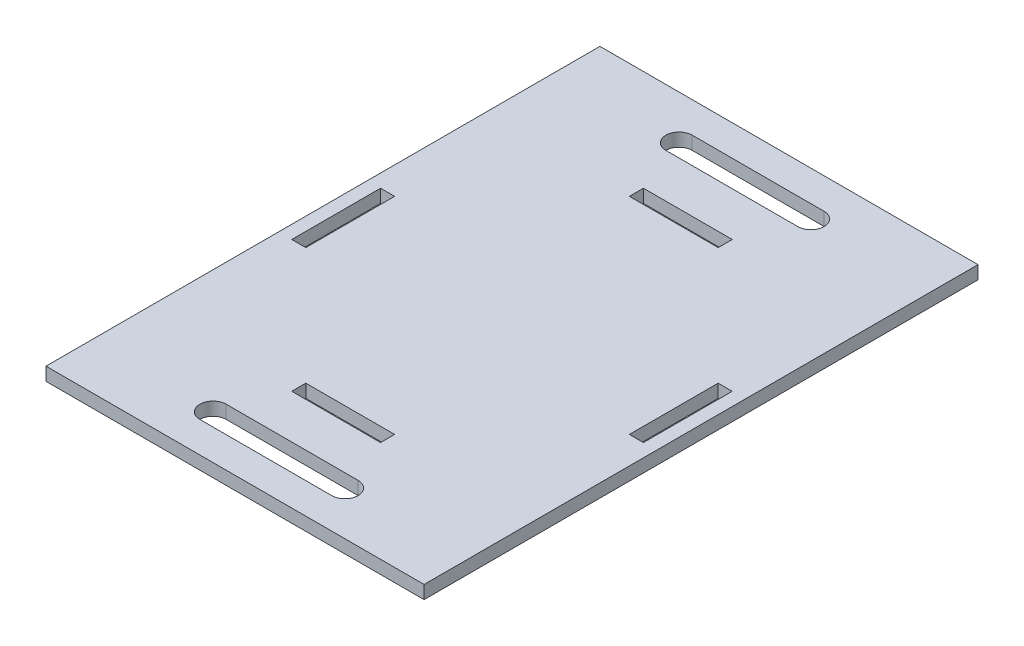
ISO-10303-21;
HEADER;
FILE_DESCRIPTION(('STEP AP214'),'2;1');
FILE_NAME('part.step','',(''),(''),'','','');
FILE_SCHEMA(('AUTOMOTIVE_DESIGN { 1 0 10303 214 1 1 1 1 }'));
ENDSEC;
DATA;
#1=APPLICATION_CONTEXT('core data for automotive mechanical design processes');
#2=APPLICATION_PROTOCOL_DEFINITION('international standard','automotive_design',2000,#1);
#3=PRODUCT_CONTEXT('',#1,'mechanical');
#4=PRODUCT('Part','Part','',(#3));
#5=PRODUCT_RELATED_PRODUCT_CATEGORY('part','',(#4));
#6=PRODUCT_DEFINITION_FORMATION('','',#4);
#7=PRODUCT_DEFINITION_CONTEXT('part definition',#1,'design');
#8=PRODUCT_DEFINITION('design','',#6,#7);
#9=PRODUCT_DEFINITION_SHAPE('','',#8);
#10=(LENGTH_UNIT() NAMED_UNIT(*) SI_UNIT(.MILLI.,.METRE.));
#11=(NAMED_UNIT(*) PLANE_ANGLE_UNIT() SI_UNIT($,.RADIAN.));
#12=(NAMED_UNIT(*) SI_UNIT($,.STERADIAN.) SOLID_ANGLE_UNIT());
#13=UNCERTAINTY_MEASURE_WITH_UNIT(LENGTH_MEASURE(1.E-05),#10,'distance_accuracy_value','');
#14=(GEOMETRIC_REPRESENTATION_CONTEXT(3) GLOBAL_UNCERTAINTY_ASSIGNED_CONTEXT((#13)) GLOBAL_UNIT_ASSIGNED_CONTEXT((#10,
#11,#12)) REPRESENTATION_CONTEXT('',''));
#15=CARTESIAN_POINT('',(0.,0.,0.));
#16=DIRECTION('',(0.,0.,1.));
#17=DIRECTION('',(1.,0.,0.));
#18=AXIS2_PLACEMENT_3D('',#15,#16,#17);
#19=CARTESIAN_POINT('',(0.,15.,0.));
#20=DIRECTION('',(0.,-1.,0.));
#21=DIRECTION('',(0.,0.,-1.));
#22=AXIS2_PLACEMENT_3D('',#19,#20,#21);
#23=PLANE('',#22);
#24=DIRECTION('',(0.,0.,1.));
#25=VECTOR('',#24,1.);
#26=CARTESIAN_POINT('',(-50.5,15.,-200.));
#27=LINE('',#26,#25);
#28=CARTESIAN_POINT('',(-50.5,15.,-200.));
#29=VERTEX_POINT('',#28);
#30=CARTESIAN_POINT('',(-50.5,15.,-184.));
#31=VERTEX_POINT('',#30);
#32=EDGE_CURVE('E345',#29,#31,#27,.T.);
#33=ORIENTED_EDGE('',*,*,#32,.F.);
#34=DIRECTION('',(-1.,0.,0.));
#35=VECTOR('',#34,1.);
#36=CARTESIAN_POINT('',(-50.5,15.,-200.));
#37=LINE('',#36,#35);
#38=CARTESIAN_POINT('',(50.5,15.,-200.));
#39=VERTEX_POINT('',#38);
#40=EDGE_CURVE('E353',#39,#29,#37,.T.);
#41=ORIENTED_EDGE('',*,*,#40,.F.);
#42=DIRECTION('',(0.,0.,-1.));
#43=VECTOR('',#42,1.);
#44=CARTESIAN_POINT('',(50.5,15.,-200.));
#45=LINE('',#44,#43);
#46=CARTESIAN_POINT('',(50.5,15.,-184.));
#47=VERTEX_POINT('',#46);
#48=EDGE_CURVE('E350',#47,#39,#45,.T.);
#49=ORIENTED_EDGE('',*,*,#48,.F.);
#50=DIRECTION('',(1.,0.,0.));
#51=VECTOR('',#50,1.);
#52=CARTESIAN_POINT('',(-50.5,15.,-184.));
#53=LINE('',#52,#51);
#54=EDGE_CURVE('E347',#31,#47,#53,.T.);
#55=ORIENTED_EDGE('',*,*,#54,.F.);
#56=EDGE_LOOP('',(#33,#41,#49,#55));
#57=FACE_BOUND('',#56,.T.);
#58=DIRECTION('',(0.,0.,-1.));
#59=VECTOR('',#58,1.);
#60=CARTESIAN_POINT('',(200.,15.,-50.5));
#61=LINE('',#60,#59);
#62=CARTESIAN_POINT('',(200.,15.,50.5));
#63=VERTEX_POINT('',#62);
#64=CARTESIAN_POINT('',(200.,15.,-50.5));
#65=VERTEX_POINT('',#64);
#66=EDGE_CURVE('E407',#63,#65,#61,.T.);
#67=ORIENTED_EDGE('',*,*,#66,.F.);
#68=DIRECTION('',(1.,0.,0.));
#69=VECTOR('',#68,1.);
#70=CARTESIAN_POINT('',(200.,15.,50.5));
#71=LINE('',#70,#69);
#72=CARTESIAN_POINT('',(184.,15.,50.5));
#73=VERTEX_POINT('',#72);
#74=EDGE_CURVE('E415',#73,#63,#71,.T.);
#75=ORIENTED_EDGE('',*,*,#74,.F.);
#76=DIRECTION('',(0.,0.,1.));
#77=VECTOR('',#76,1.);
#78=CARTESIAN_POINT('',(184.,15.,-50.5));
#79=LINE('',#78,#77);
#80=CARTESIAN_POINT('',(184.,15.,-50.5));
#81=VERTEX_POINT('',#80);
#82=EDGE_CURVE('E412',#81,#73,#79,.T.);
#83=ORIENTED_EDGE('',*,*,#82,.F.);
#84=DIRECTION('',(-1.,0.,0.));
#85=VECTOR('',#84,1.);
#86=CARTESIAN_POINT('',(200.,15.,-50.5));
#87=LINE('',#86,#85);
#88=EDGE_CURVE('E409',#65,#81,#87,.T.);
#89=ORIENTED_EDGE('',*,*,#88,.F.);
#90=EDGE_LOOP('',(#67,#75,#83,#89));
#91=FACE_BOUND('',#90,.T.);
#92=DIRECTION('',(0.,0.,1.));
#93=VECTOR('',#92,1.);
#94=CARTESIAN_POINT('',(-215.,15.,215.));
#95=LINE('',#94,#93);
#96=CARTESIAN_POINT('',(-215.,15.,-315.));
#97=VERTEX_POINT('',#96);
#98=CARTESIAN_POINT('',(-215.,15.,315.));
#99=VERTEX_POINT('',#98);
#100=EDGE_CURVE('E11',#97,#99,#95,.T.);
#101=ORIENTED_EDGE('',*,*,#100,.T.);
#102=DIRECTION('',(1.,0.,0.));
#103=VECTOR('',#102,1.);
#104=CARTESIAN_POINT('',(-215.,15.,315.));
#105=LINE('',#104,#103);
#106=CARTESIAN_POINT('',(215.,15.,315.));
#107=VERTEX_POINT('',#106);
#108=EDGE_CURVE('E260',#99,#107,#105,.T.);
#109=ORIENTED_EDGE('',*,*,#108,.T.);
#110=DIRECTION('',(0.,0.,-1.));
#111=VECTOR('',#110,1.);
#112=CARTESIAN_POINT('',(215.,15.,215.));
#113=LINE('',#112,#111);
#114=CARTESIAN_POINT('',(215.,15.,-315.));
#115=VERTEX_POINT('',#114);
#116=EDGE_CURVE('E42',#107,#115,#113,.T.);
#117=ORIENTED_EDGE('',*,*,#116,.T.);
#118=DIRECTION('',(-1.,0.,0.));
#119=VECTOR('',#118,1.);
#120=CARTESIAN_POINT('',(-215.,15.,-315.));
#121=LINE('',#120,#119);
#122=EDGE_CURVE('E301',#115,#97,#121,.T.);
#123=ORIENTED_EDGE('',*,*,#122,.T.);
#124=EDGE_LOOP('',(#101,#109,#117,#123));
#125=FACE_BOUND('',#124,.T.);
#126=DIRECTION('',(-1.,0.,0.));
#127=VECTOR('',#126,1.);
#128=CARTESIAN_POINT('',(-200.,15.,-50.4999999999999));
#129=LINE('',#128,#127);
#130=CARTESIAN_POINT('',(-184.,15.,-50.5));
#131=VERTEX_POINT('',#130);
#132=CARTESIAN_POINT('',(-200.,15.,-50.4999999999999));
#133=VERTEX_POINT('',#132);
#134=EDGE_CURVE('E376',#131,#133,#129,.T.);
#135=ORIENTED_EDGE('',*,*,#134,.F.);
#136=DIRECTION('',(0.,0.,-1.));
#137=VECTOR('',#136,1.);
#138=CARTESIAN_POINT('',(-184.,15.,-50.5));
#139=LINE('',#138,#137);
#140=CARTESIAN_POINT('',(-184.,15.,50.5));
#141=VERTEX_POINT('',#140);
#142=EDGE_CURVE('E384',#141,#131,#139,.T.);
#143=ORIENTED_EDGE('',*,*,#142,.F.);
#144=DIRECTION('',(1.,0.,0.));
#145=VECTOR('',#144,1.);
#146=CARTESIAN_POINT('',(-200.,15.,50.4999999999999));
#147=LINE('',#146,#145);
#148=CARTESIAN_POINT('',(-200.,15.,50.4999999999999));
#149=VERTEX_POINT('',#148);
#150=EDGE_CURVE('E381',#149,#141,#147,.T.);
#151=ORIENTED_EDGE('',*,*,#150,.F.);
#152=DIRECTION('',(0.,0.,1.));
#153=VECTOR('',#152,1.);
#154=CARTESIAN_POINT('',(-200.,15.,-50.4999999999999));
#155=LINE('',#154,#153);
#156=EDGE_CURVE('E378',#133,#149,#155,.T.);
#157=ORIENTED_EDGE('',*,*,#156,.F.);
#158=EDGE_LOOP('',(#135,#143,#151,#157));
#159=FACE_BOUND('',#158,.T.);
#160=DIRECTION('',(1.,0.,0.));
#161=VECTOR('',#160,1.);
#162=CARTESIAN_POINT('',(-50.5,15.,200.));
#163=LINE('',#162,#161);
#164=CARTESIAN_POINT('',(-50.5,15.,200.));
#165=VERTEX_POINT('',#164);
#166=CARTESIAN_POINT('',(50.5,15.,200.));
#167=VERTEX_POINT('',#166);
#168=EDGE_CURVE('E319',#165,#167,#163,.T.);
#169=ORIENTED_EDGE('',*,*,#168,.F.);
#170=DIRECTION('',(0.,0.,1.));
#171=VECTOR('',#170,1.);
#172=CARTESIAN_POINT('',(-50.5,15.,200.));
#173=LINE('',#172,#171);
#174=CARTESIAN_POINT('',(-50.5,15.,184.));
#175=VERTEX_POINT('',#174);
#176=EDGE_CURVE('E326',#175,#165,#173,.T.);
#177=ORIENTED_EDGE('',*,*,#176,.F.);
#178=DIRECTION('',(-1.,0.,0.));
#179=VECTOR('',#178,1.);
#180=CARTESIAN_POINT('',(-50.5,15.,184.));
#181=LINE('',#180,#179);
#182=CARTESIAN_POINT('',(50.5,15.,184.));
#183=VERTEX_POINT('',#182);
#184=EDGE_CURVE('E324',#183,#175,#181,.T.);
#185=ORIENTED_EDGE('',*,*,#184,.F.);
#186=DIRECTION('',(0.,0.,-1.));
#187=VECTOR('',#186,1.);
#188=CARTESIAN_POINT('',(50.5,15.,200.));
#189=LINE('',#188,#187);
#190=EDGE_CURVE('E321',#167,#183,#189,.T.);
#191=ORIENTED_EDGE('',*,*,#190,.F.);
#192=EDGE_LOOP('',(#169,#177,#185,#191));
#193=FACE_BOUND('',#192,.T.);
#194=DIRECTION('',(-1.,0.,0.));
#195=VECTOR('',#194,1.);
#196=CARTESIAN_POINT('',(75.,15.,-280.));
#197=LINE('',#196,#195);
#198=CARTESIAN_POINT('',(75.,15.,-280.));
#199=VERTEX_POINT('',#198);
#200=CARTESIAN_POINT('',(-75.,15.,-280.));
#201=VERTEX_POINT('',#200);
#202=EDGE_CURVE('E291',#199,#201,#197,.T.);
#203=ORIENTED_EDGE('',*,*,#202,.F.);
#204=CARTESIAN_POINT('',(75.,15.,-265.));
#205=DIRECTION('',(0.,1.,0.));
#206=DIRECTION('',(0.,0.,1.));
#207=AXIS2_PLACEMENT_3D('',#204,#205,#206);
#208=CIRCLE('',#207,15.);
#209=CARTESIAN_POINT('',(75.,15.,-250.));
#210=VERTEX_POINT('',#209);
#211=EDGE_CURVE('E273',#210,#199,#208,.T.);
#212=ORIENTED_EDGE('',*,*,#211,.F.);
#213=DIRECTION('',(1.,0.,0.));
#214=VECTOR('',#213,1.);
#215=CARTESIAN_POINT('',(75.,15.,-250.));
#216=LINE('',#215,#214);
#217=CARTESIAN_POINT('',(-75.,15.,-250.));
#218=VERTEX_POINT('',#217);
#219=EDGE_CURVE('E280',#218,#210,#216,.T.);
#220=ORIENTED_EDGE('',*,*,#219,.F.);
#221=CARTESIAN_POINT('',(-75.,15.,-265.));
#222=DIRECTION('',(0.,1.,0.));
#223=DIRECTION('',(0.,0.,1.));
#224=AXIS2_PLACEMENT_3D('',#221,#222,#223);
#225=CIRCLE('',#224,15.);
#226=EDGE_CURVE('E294',#201,#218,#225,.T.);
#227=ORIENTED_EDGE('',*,*,#226,.F.);
#228=EDGE_LOOP('',(#203,#212,#220,#227));
#229=FACE_BOUND('',#228,.T.);
#230=DIRECTION('',(-1.,0.,0.));
#231=VECTOR('',#230,1.);
#232=CARTESIAN_POINT('',(75.,15.,250.));
#233=LINE('',#232,#231);
#234=CARTESIAN_POINT('',(75.,15.,250.));
#235=VERTEX_POINT('',#234);
#236=CARTESIAN_POINT('',(-75.,15.,250.));
#237=VERTEX_POINT('',#236);
#238=EDGE_CURVE('E254',#235,#237,#233,.T.);
#239=ORIENTED_EDGE('',*,*,#238,.F.);
#240=CARTESIAN_POINT('',(75.,15.,265.));
#241=DIRECTION('',(0.,1.,0.));
#242=DIRECTION('',(0.,0.,-1.));
#243=AXIS2_PLACEMENT_3D('',#240,#241,#242);
#244=CIRCLE('',#243,15.);
#245=CARTESIAN_POINT('',(75.,15.,280.));
#246=VERTEX_POINT('',#245);
#247=EDGE_CURVE('E228',#246,#235,#244,.T.);
#248=ORIENTED_EDGE('',*,*,#247,.F.);
#249=DIRECTION('',(1.,0.,0.));
#250=VECTOR('',#249,1.);
#251=CARTESIAN_POINT('',(75.,15.,280.));
#252=LINE('',#251,#250);
#253=CARTESIAN_POINT('',(-75.,15.,280.));
#254=VERTEX_POINT('',#253);
#255=EDGE_CURVE('E245',#254,#246,#252,.T.);
#256=ORIENTED_EDGE('',*,*,#255,.F.);
#257=CARTESIAN_POINT('',(-75.,15.,265.));
#258=DIRECTION('',(0.,1.,0.));
#259=DIRECTION('',(0.,0.,-1.));
#260=AXIS2_PLACEMENT_3D('',#257,#258,#259);
#261=CIRCLE('',#260,15.);
#262=EDGE_CURVE('E248',#237,#254,#261,.T.);
#263=ORIENTED_EDGE('',*,*,#262,.F.);
#264=EDGE_LOOP('',(#239,#248,#256,#263));
#265=FACE_BOUND('',#264,.T.);
#266=ADVANCED_FACE('F33',(#57,#91,#125,#159,#193,#229,#265),#23,.F.);
#267=CARTESIAN_POINT('',(0.,0.,0.));
#268=DIRECTION('',(0.,-1.,0.));
#269=DIRECTION('',(0.,0.,-1.));
#270=AXIS2_PLACEMENT_3D('',#267,#268,#269);
#271=PLANE('',#270);
#272=DIRECTION('',(0.,0.,-1.));
#273=VECTOR('',#272,1.);
#274=CARTESIAN_POINT('',(215.,0.,215.));
#275=LINE('',#274,#273);
#276=CARTESIAN_POINT('',(215.,0.,315.));
#277=VERTEX_POINT('',#276);
#278=CARTESIAN_POINT('',(215.,0.,-315.));
#279=VERTEX_POINT('',#278);
#280=EDGE_CURVE('E437',#277,#279,#275,.T.);
#281=ORIENTED_EDGE('',*,*,#280,.F.);
#282=DIRECTION('',(1.,0.,0.));
#283=VECTOR('',#282,1.);
#284=CARTESIAN_POINT('',(-215.,0.,315.));
#285=LINE('',#284,#283);
#286=CARTESIAN_POINT('',(-215.,0.,315.));
#287=VERTEX_POINT('',#286);
#288=EDGE_CURVE('E264',#287,#277,#285,.T.);
#289=ORIENTED_EDGE('',*,*,#288,.F.);
#290=DIRECTION('',(0.,0.,1.));
#291=VECTOR('',#290,1.);
#292=CARTESIAN_POINT('',(-215.,0.,215.));
#293=LINE('',#292,#291);
#294=CARTESIAN_POINT('',(-215.,0.,-315.));
#295=VERTEX_POINT('',#294);
#296=EDGE_CURVE('E37',#295,#287,#293,.T.);
#297=ORIENTED_EDGE('',*,*,#296,.F.);
#298=DIRECTION('',(-1.,0.,0.));
#299=VECTOR('',#298,1.);
#300=CARTESIAN_POINT('',(-215.,0.,-315.));
#301=LINE('',#300,#299);
#302=EDGE_CURVE('E308',#279,#295,#301,.T.);
#303=ORIENTED_EDGE('',*,*,#302,.F.);
#304=EDGE_LOOP('',(#281,#289,#297,#303));
#305=FACE_BOUND('',#304,.T.);
#306=DIRECTION('',(1.,0.,0.));
#307=VECTOR('',#306,1.);
#308=CARTESIAN_POINT('',(200.,0.,50.5));
#309=LINE('',#308,#307);
#310=CARTESIAN_POINT('',(184.,0.,50.5));
#311=VERTEX_POINT('',#310);
#312=CARTESIAN_POINT('',(200.,0.,50.5));
#313=VERTEX_POINT('',#312);
#314=EDGE_CURVE('E410',#311,#313,#309,.T.);
#315=ORIENTED_EDGE('',*,*,#314,.T.);
#316=DIRECTION('',(0.,0.,-1.));
#317=VECTOR('',#316,1.);
#318=CARTESIAN_POINT('',(200.,0.,-50.5));
#319=LINE('',#318,#317);
#320=CARTESIAN_POINT('',(200.,0.,-50.5));
#321=VERTEX_POINT('',#320);
#322=EDGE_CURVE('E406',#313,#321,#319,.T.);
#323=ORIENTED_EDGE('',*,*,#322,.T.);
#324=DIRECTION('',(-1.,0.,0.));
#325=VECTOR('',#324,1.);
#326=CARTESIAN_POINT('',(200.,0.,-50.5));
#327=LINE('',#326,#325);
#328=CARTESIAN_POINT('',(184.,0.,-50.5));
#329=VERTEX_POINT('',#328);
#330=EDGE_CURVE('E420',#321,#329,#327,.T.);
#331=ORIENTED_EDGE('',*,*,#330,.T.);
#332=DIRECTION('',(0.,0.,1.));
#333=VECTOR('',#332,1.);
#334=CARTESIAN_POINT('',(184.,0.,-50.5));
#335=LINE('',#334,#333);
#336=EDGE_CURVE('E423',#329,#311,#335,.T.);
#337=ORIENTED_EDGE('',*,*,#336,.T.);
#338=EDGE_LOOP('',(#315,#323,#331,#337));
#339=FACE_BOUND('',#338,.T.);
#340=DIRECTION('',(0.,0.,-1.));
#341=VECTOR('',#340,1.);
#342=CARTESIAN_POINT('',(-184.,0.,-50.5));
#343=LINE('',#342,#341);
#344=CARTESIAN_POINT('',(-184.,0.,50.5));
#345=VERTEX_POINT('',#344);
#346=CARTESIAN_POINT('',(-184.,0.,-50.5));
#347=VERTEX_POINT('',#346);
#348=EDGE_CURVE('E379',#345,#347,#343,.T.);
#349=ORIENTED_EDGE('',*,*,#348,.T.);
#350=DIRECTION('',(-1.,0.,0.));
#351=VECTOR('',#350,1.);
#352=CARTESIAN_POINT('',(-200.,0.,-50.4999999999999));
#353=LINE('',#352,#351);
#354=CARTESIAN_POINT('',(-200.,0.,-50.4999999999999));
#355=VERTEX_POINT('',#354);
#356=EDGE_CURVE('E375',#347,#355,#353,.T.);
#357=ORIENTED_EDGE('',*,*,#356,.T.);
#358=DIRECTION('',(0.,0.,1.));
#359=VECTOR('',#358,1.);
#360=CARTESIAN_POINT('',(-200.,0.,-50.4999999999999));
#361=LINE('',#360,#359);
#362=CARTESIAN_POINT('',(-200.,0.,50.4999999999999));
#363=VERTEX_POINT('',#362);
#364=EDGE_CURVE('E389',#355,#363,#361,.T.);
#365=ORIENTED_EDGE('',*,*,#364,.T.);
#366=DIRECTION('',(1.,0.,0.));
#367=VECTOR('',#366,1.);
#368=CARTESIAN_POINT('',(-200.,0.,50.4999999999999));
#369=LINE('',#368,#367);
#370=EDGE_CURVE('E392',#363,#345,#369,.T.);
#371=ORIENTED_EDGE('',*,*,#370,.T.);
#372=EDGE_LOOP('',(#349,#357,#365,#371));
#373=FACE_BOUND('',#372,.T.);
#374=DIRECTION('',(-1.,0.,0.));
#375=VECTOR('',#374,1.);
#376=CARTESIAN_POINT('',(-50.5,0.,-200.));
#377=LINE('',#376,#375);
#378=CARTESIAN_POINT('',(50.5,0.,-200.));
#379=VERTEX_POINT('',#378);
#380=CARTESIAN_POINT('',(-50.5,0.,-200.));
#381=VERTEX_POINT('',#380);
#382=EDGE_CURVE('E348',#379,#381,#377,.T.);
#383=ORIENTED_EDGE('',*,*,#382,.T.);
#384=DIRECTION('',(0.,0.,1.));
#385=VECTOR('',#384,1.);
#386=CARTESIAN_POINT('',(-50.5,0.,-200.));
#387=LINE('',#386,#385);
#388=CARTESIAN_POINT('',(-50.5,0.,-184.));
#389=VERTEX_POINT('',#388);
#390=EDGE_CURVE('E344',#381,#389,#387,.T.);
#391=ORIENTED_EDGE('',*,*,#390,.T.);
#392=DIRECTION('',(1.,0.,0.));
#393=VECTOR('',#392,1.);
#394=CARTESIAN_POINT('',(-50.5,0.,-184.));
#395=LINE('',#394,#393);
#396=CARTESIAN_POINT('',(50.5,0.,-184.));
#397=VERTEX_POINT('',#396);
#398=EDGE_CURVE('E358',#389,#397,#395,.T.);
#399=ORIENTED_EDGE('',*,*,#398,.T.);
#400=DIRECTION('',(0.,0.,-1.));
#401=VECTOR('',#400,1.);
#402=CARTESIAN_POINT('',(50.5,0.,-200.));
#403=LINE('',#402,#401);
#404=EDGE_CURVE('E361',#397,#379,#403,.T.);
#405=ORIENTED_EDGE('',*,*,#404,.T.);
#406=EDGE_LOOP('',(#383,#391,#399,#405));
#407=FACE_BOUND('',#406,.T.);
#408=DIRECTION('',(0.,0.,1.));
#409=VECTOR('',#408,1.);
#410=CARTESIAN_POINT('',(-50.5,0.,200.));
#411=LINE('',#410,#409);
#412=CARTESIAN_POINT('',(-50.5,0.,184.));
#413=VERTEX_POINT('',#412);
#414=CARTESIAN_POINT('',(-50.5,0.,200.));
#415=VERTEX_POINT('',#414);
#416=EDGE_CURVE('E322',#413,#415,#411,.T.);
#417=ORIENTED_EDGE('',*,*,#416,.T.);
#418=DIRECTION('',(1.,0.,0.));
#419=VECTOR('',#418,1.);
#420=CARTESIAN_POINT('',(-50.5,0.,200.));
#421=LINE('',#420,#419);
#422=CARTESIAN_POINT('',(50.5,0.,200.));
#423=VERTEX_POINT('',#422);
#424=EDGE_CURVE('E58',#415,#423,#421,.T.);
#425=ORIENTED_EDGE('',*,*,#424,.T.);
#426=DIRECTION('',(0.,0.,-1.));
#427=VECTOR('',#426,1.);
#428=CARTESIAN_POINT('',(50.5,0.,200.));
#429=LINE('',#428,#427);
#430=CARTESIAN_POINT('',(50.5,0.,184.));
#431=VERTEX_POINT('',#430);
#432=EDGE_CURVE('E330',#423,#431,#429,.T.);
#433=ORIENTED_EDGE('',*,*,#432,.T.);
#434=DIRECTION('',(-1.,0.,0.));
#435=VECTOR('',#434,1.);
#436=CARTESIAN_POINT('',(-50.5,0.,184.));
#437=LINE('',#436,#435);
#438=EDGE_CURVE('E333',#431,#413,#437,.T.);
#439=ORIENTED_EDGE('',*,*,#438,.T.);
#440=EDGE_LOOP('',(#417,#425,#433,#439));
#441=FACE_BOUND('',#440,.T.);
#442=CARTESIAN_POINT('',(75.,0.,-265.));
#443=DIRECTION('',(0.,1.,0.));
#444=DIRECTION('',(0.,0.,1.));
#445=AXIS2_PLACEMENT_3D('',#442,#443,#444);
#446=CIRCLE('',#445,15.);
#447=CARTESIAN_POINT('',(75.,0.,-250.));
#448=VERTEX_POINT('',#447);
#449=CARTESIAN_POINT('',(75.,0.,-280.));
#450=VERTEX_POINT('',#449);
#451=EDGE_CURVE('E276',#448,#450,#446,.T.);
#452=ORIENTED_EDGE('',*,*,#451,.T.);
#453=DIRECTION('',(-1.,0.,0.));
#454=VECTOR('',#453,1.);
#455=CARTESIAN_POINT('',(75.,0.,-280.));
#456=LINE('',#455,#454);
#457=CARTESIAN_POINT('',(-75.,0.,-280.));
#458=VERTEX_POINT('',#457);
#459=EDGE_CURVE('E279',#450,#458,#456,.T.);
#460=ORIENTED_EDGE('',*,*,#459,.T.);
#461=CARTESIAN_POINT('',(-75.,0.,-265.));
#462=DIRECTION('',(0.,1.,0.));
#463=DIRECTION('',(0.,0.,1.));
#464=AXIS2_PLACEMENT_3D('',#461,#462,#463);
#465=CIRCLE('',#464,15.);
#466=CARTESIAN_POINT('',(-75.,0.,-250.));
#467=VERTEX_POINT('',#466);
#468=EDGE_CURVE('E283',#458,#467,#465,.T.);
#469=ORIENTED_EDGE('',*,*,#468,.T.);
#470=DIRECTION('',(1.,0.,0.));
#471=VECTOR('',#470,1.);
#472=CARTESIAN_POINT('',(75.,0.,-250.));
#473=LINE('',#472,#471);
#474=EDGE_CURVE('E286',#467,#448,#473,.T.);
#475=ORIENTED_EDGE('',*,*,#474,.T.);
#476=EDGE_LOOP('',(#452,#460,#469,#475));
#477=FACE_BOUND('',#476,.T.);
#478=CARTESIAN_POINT('',(75.,0.,265.));
#479=DIRECTION('',(0.,1.,0.));
#480=DIRECTION('',(0.,0.,-1.));
#481=AXIS2_PLACEMENT_3D('',#478,#479,#480);
#482=CIRCLE('',#481,15.);
#483=CARTESIAN_POINT('',(75.,0.,280.));
#484=VERTEX_POINT('',#483);
#485=CARTESIAN_POINT('',(75.,0.,250.));
#486=VERTEX_POINT('',#485);
#487=EDGE_CURVE('E225',#484,#486,#482,.T.);
#488=ORIENTED_EDGE('',*,*,#487,.T.);
#489=DIRECTION('',(-1.,0.,0.));
#490=VECTOR('',#489,1.);
#491=CARTESIAN_POINT('',(75.,0.,250.));
#492=LINE('',#491,#490);
#493=CARTESIAN_POINT('',(-75.,0.,250.));
#494=VERTEX_POINT('',#493);
#495=EDGE_CURVE('E237',#486,#494,#492,.T.);
#496=ORIENTED_EDGE('',*,*,#495,.T.);
#497=CARTESIAN_POINT('',(-75.,0.,265.));
#498=DIRECTION('',(0.,1.,0.));
#499=DIRECTION('',(0.,0.,-1.));
#500=AXIS2_PLACEMENT_3D('',#497,#498,#499);
#501=CIRCLE('',#500,15.);
#502=CARTESIAN_POINT('',(-75.,0.,280.));
#503=VERTEX_POINT('',#502);
#504=EDGE_CURVE('E241',#494,#503,#501,.T.);
#505=ORIENTED_EDGE('',*,*,#504,.T.);
#506=DIRECTION('',(1.,0.,0.));
#507=VECTOR('',#506,1.);
#508=CARTESIAN_POINT('',(75.,0.,280.));
#509=LINE('',#508,#507);
#510=EDGE_CURVE('E233',#503,#484,#509,.T.);
#511=ORIENTED_EDGE('',*,*,#510,.T.);
#512=EDGE_LOOP('',(#488,#496,#505,#511));
#513=FACE_BOUND('',#512,.T.);
#514=ADVANCED_FACE('F243',(#305,#339,#373,#407,#441,#477,#513),#271,.T.);
#515=CARTESIAN_POINT('',(215.,15.,215.));
#516=DIRECTION('',(-1.,0.,0.));
#517=DIRECTION('',(0.,0.,1.));
#518=AXIS2_PLACEMENT_3D('',#515,#516,#517);
#519=PLANE('',#518);
#520=ORIENTED_EDGE('',*,*,#280,.T.);
#521=DIRECTION('',(0.,1.,0.));
#522=VECTOR('',#521,1.);
#523=CARTESIAN_POINT('',(215.,0.,-315.));
#524=LINE('',#523,#522);
#525=EDGE_CURVE('E311',#279,#115,#524,.T.);
#526=ORIENTED_EDGE('',*,*,#525,.T.);
#527=ORIENTED_EDGE('',*,*,#116,.F.);
#528=DIRECTION('',(0.,1.,0.));
#529=VECTOR('',#528,1.);
#530=CARTESIAN_POINT('',(215.,0.,315.));
#531=LINE('',#530,#529);
#532=EDGE_CURVE('E270',#277,#107,#531,.T.);
#533=ORIENTED_EDGE('',*,*,#532,.F.);
#534=EDGE_LOOP('',(#520,#526,#527,#533));
#535=FACE_BOUND('',#534,.T.);
#536=ADVANCED_FACE('F35',(#535),#519,.F.);
#537=CARTESIAN_POINT('',(-215.,15.,215.));
#538=DIRECTION('',(1.,0.,0.));
#539=DIRECTION('',(0.,0.,-1.));
#540=AXIS2_PLACEMENT_3D('',#537,#538,#539);
#541=PLANE('',#540);
#542=ORIENTED_EDGE('',*,*,#296,.T.);
#543=DIRECTION('',(0.,1.,0.));
#544=VECTOR('',#543,1.);
#545=CARTESIAN_POINT('',(-215.,0.,315.));
#546=LINE('',#545,#544);
#547=EDGE_CURVE('E267',#287,#99,#546,.T.);
#548=ORIENTED_EDGE('',*,*,#547,.T.);
#549=ORIENTED_EDGE('',*,*,#100,.F.);
#550=DIRECTION('',(0.,1.,0.));
#551=VECTOR('',#550,1.);
#552=CARTESIAN_POINT('',(-215.,0.,-315.));
#553=LINE('',#552,#551);
#554=EDGE_CURVE('E314',#295,#97,#553,.T.);
#555=ORIENTED_EDGE('',*,*,#554,.F.);
#556=EDGE_LOOP('',(#542,#548,#549,#555));
#557=FACE_BOUND('',#556,.T.);
#558=ADVANCED_FACE('F444',(#557),#541,.F.);
#559=CARTESIAN_POINT('',(200.,15.,-50.5));
#560=DIRECTION('',(-1.,0.,0.));
#561=DIRECTION('',(0.,0.,1.));
#562=AXIS2_PLACEMENT_3D('',#559,#560,#561);
#563=PLANE('',#562);
#564=ORIENTED_EDGE('',*,*,#322,.F.);
#565=DIRECTION('',(0.,-1.,0.));
#566=VECTOR('',#565,1.);
#567=CARTESIAN_POINT('',(200.,15.,50.5));
#568=LINE('',#567,#566);
#569=EDGE_CURVE('E417',#63,#313,#568,.T.);
#570=ORIENTED_EDGE('',*,*,#569,.F.);
#571=ORIENTED_EDGE('',*,*,#66,.T.);
#572=DIRECTION('',(0.,-1.,0.));
#573=VECTOR('',#572,1.);
#574=CARTESIAN_POINT('',(200.,15.,-50.5));
#575=LINE('',#574,#573);
#576=EDGE_CURVE('E434',#65,#321,#575,.T.);
#577=ORIENTED_EDGE('',*,*,#576,.T.);
#578=EDGE_LOOP('',(#564,#570,#571,#577));
#579=FACE_BOUND('',#578,.T.);
#580=ADVANCED_FACE('F480',(#579),#563,.T.);
#581=CARTESIAN_POINT('',(200.,15.,-50.5));
#582=DIRECTION('',(0.,0.,1.));
#583=DIRECTION('',(1.,0.,0.));
#584=AXIS2_PLACEMENT_3D('',#581,#582,#583);
#585=PLANE('',#584);
#586=ORIENTED_EDGE('',*,*,#330,.F.);
#587=ORIENTED_EDGE('',*,*,#576,.F.);
#588=ORIENTED_EDGE('',*,*,#88,.T.);
#589=DIRECTION('',(0.,-1.,0.));
#590=VECTOR('',#589,1.);
#591=CARTESIAN_POINT('',(184.,15.,-50.5));
#592=LINE('',#591,#590);
#593=EDGE_CURVE('E432',#81,#329,#592,.T.);
#594=ORIENTED_EDGE('',*,*,#593,.T.);
#595=EDGE_LOOP('',(#586,#587,#588,#594));
#596=FACE_BOUND('',#595,.T.);
#597=ADVANCED_FACE('F487',(#596),#585,.T.);
#598=CARTESIAN_POINT('',(184.,15.,-50.5));
#599=DIRECTION('',(1.,0.,0.));
#600=DIRECTION('',(0.,0.,-1.));
#601=AXIS2_PLACEMENT_3D('',#598,#599,#600);
#602=PLANE('',#601);
#603=ORIENTED_EDGE('',*,*,#336,.F.);
#604=ORIENTED_EDGE('',*,*,#593,.F.);
#605=ORIENTED_EDGE('',*,*,#82,.T.);
#606=DIRECTION('',(0.,-1.,0.));
#607=VECTOR('',#606,1.);
#608=CARTESIAN_POINT('',(184.,15.,50.5));
#609=LINE('',#608,#607);
#610=EDGE_CURVE('E430',#73,#311,#609,.T.);
#611=ORIENTED_EDGE('',*,*,#610,.T.);
#612=EDGE_LOOP('',(#603,#604,#605,#611));
#613=FACE_BOUND('',#612,.T.);
#614=ADVANCED_FACE('F626',(#613),#602,.T.);
#615=CARTESIAN_POINT('',(200.,15.,50.5));
#616=DIRECTION('',(0.,0.,-1.));
#617=DIRECTION('',(-1.,0.,0.));
#618=AXIS2_PLACEMENT_3D('',#615,#616,#617);
#619=PLANE('',#618);
#620=ORIENTED_EDGE('',*,*,#314,.F.);
#621=ORIENTED_EDGE('',*,*,#610,.F.);
#622=ORIENTED_EDGE('',*,*,#74,.T.);
#623=ORIENTED_EDGE('',*,*,#569,.T.);
#624=EDGE_LOOP('',(#620,#621,#622,#623));
#625=FACE_BOUND('',#624,.T.);
#626=ADVANCED_FACE('F616',(#625),#619,.T.);
#627=CARTESIAN_POINT('',(-200.,15.,-50.4999999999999));
#628=DIRECTION('',(0.,0.,1.));
#629=DIRECTION('',(1.,0.,0.));
#630=AXIS2_PLACEMENT_3D('',#627,#628,#629);
#631=PLANE('',#630);
#632=ORIENTED_EDGE('',*,*,#356,.F.);
#633=DIRECTION('',(0.,-1.,0.));
#634=VECTOR('',#633,1.);
#635=CARTESIAN_POINT('',(-184.,15.,-50.5));
#636=LINE('',#635,#634);
#637=EDGE_CURVE('E386',#131,#347,#636,.T.);
#638=ORIENTED_EDGE('',*,*,#637,.F.);
#639=ORIENTED_EDGE('',*,*,#134,.T.);
#640=DIRECTION('',(0.,-1.,0.));
#641=VECTOR('',#640,1.);
#642=CARTESIAN_POINT('',(-200.,15.,-50.4999999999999));
#643=LINE('',#642,#641);
#644=EDGE_CURVE('E403',#133,#355,#643,.T.);
#645=ORIENTED_EDGE('',*,*,#644,.T.);
#646=EDGE_LOOP('',(#632,#638,#639,#645));
#647=FACE_BOUND('',#646,.T.);
#648=ADVANCED_FACE('F606',(#647),#631,.T.);
#649=CARTESIAN_POINT('',(-200.,15.,-50.4999999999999));
#650=DIRECTION('',(1.,0.,0.));
#651=DIRECTION('',(0.,0.,-1.));
#652=AXIS2_PLACEMENT_3D('',#649,#650,#651);
#653=PLANE('',#652);
#654=ORIENTED_EDGE('',*,*,#364,.F.);
#655=ORIENTED_EDGE('',*,*,#644,.F.);
#656=ORIENTED_EDGE('',*,*,#156,.T.);
#657=DIRECTION('',(0.,-1.,0.));
#658=VECTOR('',#657,1.);
#659=CARTESIAN_POINT('',(-200.,15.,50.4999999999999));
#660=LINE('',#659,#658);
#661=EDGE_CURVE('E401',#149,#363,#660,.T.);
#662=ORIENTED_EDGE('',*,*,#661,.T.);
#663=EDGE_LOOP('',(#654,#655,#656,#662));
#664=FACE_BOUND('',#663,.T.);
#665=ADVANCED_FACE('F596',(#664),#653,.T.);
#666=CARTESIAN_POINT('',(-200.,15.,50.4999999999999));
#667=DIRECTION('',(0.,0.,-1.));
#668=DIRECTION('',(-1.,0.,0.));
#669=AXIS2_PLACEMENT_3D('',#666,#667,#668);
#670=PLANE('',#669);
#671=ORIENTED_EDGE('',*,*,#370,.F.);
#672=ORIENTED_EDGE('',*,*,#661,.F.);
#673=ORIENTED_EDGE('',*,*,#150,.T.);
#674=DIRECTION('',(0.,-1.,0.));
#675=VECTOR('',#674,1.);
#676=CARTESIAN_POINT('',(-184.,15.,50.5));
#677=LINE('',#676,#675);
#678=EDGE_CURVE('E399',#141,#345,#677,.T.);
#679=ORIENTED_EDGE('',*,*,#678,.T.);
#680=EDGE_LOOP('',(#671,#672,#673,#679));
#681=FACE_BOUND('',#680,.T.);
#682=ADVANCED_FACE('F586',(#681),#670,.T.);
#683=CARTESIAN_POINT('',(-184.,15.,-50.5));
#684=DIRECTION('',(-1.,0.,0.));
#685=DIRECTION('',(0.,0.,1.));
#686=AXIS2_PLACEMENT_3D('',#683,#684,#685);
#687=PLANE('',#686);
#688=ORIENTED_EDGE('',*,*,#348,.F.);
#689=ORIENTED_EDGE('',*,*,#678,.F.);
#690=ORIENTED_EDGE('',*,*,#142,.T.);
#691=ORIENTED_EDGE('',*,*,#637,.T.);
#692=EDGE_LOOP('',(#688,#689,#690,#691));
#693=FACE_BOUND('',#692,.T.);
#694=ADVANCED_FACE('F576',(#693),#687,.T.);
#695=CARTESIAN_POINT('',(-50.5,15.,-200.));
#696=DIRECTION('',(1.,0.,0.));
#697=DIRECTION('',(0.,0.,-1.));
#698=AXIS2_PLACEMENT_3D('',#695,#696,#697);
#699=PLANE('',#698);
#700=ORIENTED_EDGE('',*,*,#390,.F.);
#701=DIRECTION('',(0.,-1.,0.));
#702=VECTOR('',#701,1.);
#703=CARTESIAN_POINT('',(-50.5,15.,-200.));
#704=LINE('',#703,#702);
#705=EDGE_CURVE('E355',#29,#381,#704,.T.);
#706=ORIENTED_EDGE('',*,*,#705,.F.);
#707=ORIENTED_EDGE('',*,*,#32,.T.);
#708=DIRECTION('',(0.,-1.,0.));
#709=VECTOR('',#708,1.);
#710=CARTESIAN_POINT('',(-50.5,15.,-184.));
#711=LINE('',#710,#709);
#712=EDGE_CURVE('E372',#31,#389,#711,.T.);
#713=ORIENTED_EDGE('',*,*,#712,.T.);
#714=EDGE_LOOP('',(#700,#706,#707,#713));
#715=FACE_BOUND('',#714,.T.);
#716=ADVANCED_FACE('F566',(#715),#699,.T.);
#717=CARTESIAN_POINT('',(-50.5,15.,-184.));
#718=DIRECTION('',(0.,0.,-1.));
#719=DIRECTION('',(-1.,0.,0.));
#720=AXIS2_PLACEMENT_3D('',#717,#718,#719);
#721=PLANE('',#720);
#722=ORIENTED_EDGE('',*,*,#398,.F.);
#723=ORIENTED_EDGE('',*,*,#712,.F.);
#724=ORIENTED_EDGE('',*,*,#54,.T.);
#725=DIRECTION('',(0.,-1.,0.));
#726=VECTOR('',#725,1.);
#727=CARTESIAN_POINT('',(50.5,15.,-184.));
#728=LINE('',#727,#726);
#729=EDGE_CURVE('E370',#47,#397,#728,.T.);
#730=ORIENTED_EDGE('',*,*,#729,.T.);
#731=EDGE_LOOP('',(#722,#723,#724,#730));
#732=FACE_BOUND('',#731,.T.);
#733=ADVANCED_FACE('F556',(#732),#721,.T.);
#734=CARTESIAN_POINT('',(50.5,15.,-200.));
#735=DIRECTION('',(-1.,0.,0.));
#736=DIRECTION('',(0.,0.,1.));
#737=AXIS2_PLACEMENT_3D('',#734,#735,#736);
#738=PLANE('',#737);
#739=ORIENTED_EDGE('',*,*,#404,.F.);
#740=ORIENTED_EDGE('',*,*,#729,.F.);
#741=ORIENTED_EDGE('',*,*,#48,.T.);
#742=DIRECTION('',(0.,-1.,0.));
#743=VECTOR('',#742,1.);
#744=CARTESIAN_POINT('',(50.5,15.,-200.));
#745=LINE('',#744,#743);
#746=EDGE_CURVE('E368',#39,#379,#745,.T.);
#747=ORIENTED_EDGE('',*,*,#746,.T.);
#748=EDGE_LOOP('',(#739,#740,#741,#747));
#749=FACE_BOUND('',#748,.T.);
#750=ADVANCED_FACE('F546',(#749),#738,.T.);
#751=CARTESIAN_POINT('',(-50.5,15.,-200.));
#752=DIRECTION('',(0.,0.,1.));
#753=DIRECTION('',(1.,0.,0.));
#754=AXIS2_PLACEMENT_3D('',#751,#752,#753);
#755=PLANE('',#754);
#756=ORIENTED_EDGE('',*,*,#382,.F.);
#757=ORIENTED_EDGE('',*,*,#746,.F.);
#758=ORIENTED_EDGE('',*,*,#40,.T.);
#759=ORIENTED_EDGE('',*,*,#705,.T.);
#760=EDGE_LOOP('',(#756,#757,#758,#759));
#761=FACE_BOUND('',#760,.T.);
#762=ADVANCED_FACE('F537',(#761),#755,.T.);
#763=CARTESIAN_POINT('',(-50.5,15.,200.));
#764=DIRECTION('',(0.,0.,-1.));
#765=DIRECTION('',(-1.,0.,0.));
#766=AXIS2_PLACEMENT_3D('',#763,#764,#765);
#767=PLANE('',#766);
#768=ORIENTED_EDGE('',*,*,#424,.F.);
#769=DIRECTION('',(0.,-1.,0.));
#770=VECTOR('',#769,1.);
#771=CARTESIAN_POINT('',(-50.5,15.,200.));
#772=LINE('',#771,#770);
#773=EDGE_CURVE('E328',#165,#415,#772,.T.);
#774=ORIENTED_EDGE('',*,*,#773,.F.);
#775=ORIENTED_EDGE('',*,*,#168,.T.);
#776=DIRECTION('',(0.,-1.,0.));
#777=VECTOR('',#776,1.);
#778=CARTESIAN_POINT('',(50.5,15.,200.));
#779=LINE('',#778,#777);
#780=EDGE_CURVE('E342',#167,#423,#779,.T.);
#781=ORIENTED_EDGE('',*,*,#780,.T.);
#782=EDGE_LOOP('',(#768,#774,#775,#781));
#783=FACE_BOUND('',#782,.T.);
#784=ADVANCED_FACE('F527',(#783),#767,.T.);
#785=CARTESIAN_POINT('',(50.5,15.,200.));
#786=DIRECTION('',(-1.,0.,0.));
#787=DIRECTION('',(0.,0.,1.));
#788=AXIS2_PLACEMENT_3D('',#785,#786,#787);
#789=PLANE('',#788);
#790=ORIENTED_EDGE('',*,*,#432,.F.);
#791=ORIENTED_EDGE('',*,*,#780,.F.);
#792=ORIENTED_EDGE('',*,*,#190,.T.);
#793=DIRECTION('',(0.,-1.,0.));
#794=VECTOR('',#793,1.);
#795=CARTESIAN_POINT('',(50.5,15.,184.));
#796=LINE('',#795,#794);
#797=EDGE_CURVE('E340',#183,#431,#796,.T.);
#798=ORIENTED_EDGE('',*,*,#797,.T.);
#799=EDGE_LOOP('',(#790,#791,#792,#798));
#800=FACE_BOUND('',#799,.T.);
#801=ADVANCED_FACE('F517',(#800),#789,.T.);
#802=CARTESIAN_POINT('',(-50.5,15.,184.));
#803=DIRECTION('',(0.,0.,1.));
#804=DIRECTION('',(1.,0.,0.));
#805=AXIS2_PLACEMENT_3D('',#802,#803,#804);
#806=PLANE('',#805);
#807=ORIENTED_EDGE('',*,*,#438,.F.);
#808=ORIENTED_EDGE('',*,*,#797,.F.);
#809=ORIENTED_EDGE('',*,*,#184,.T.);
#810=DIRECTION('',(0.,-1.,0.));
#811=VECTOR('',#810,1.);
#812=CARTESIAN_POINT('',(-50.5,15.,184.));
#813=LINE('',#812,#811);
#814=EDGE_CURVE('E50',#175,#413,#813,.T.);
#815=ORIENTED_EDGE('',*,*,#814,.T.);
#816=EDGE_LOOP('',(#807,#808,#809,#815));
#817=FACE_BOUND('',#816,.T.);
#818=ADVANCED_FACE('F468',(#817),#806,.T.);
#819=CARTESIAN_POINT('',(-50.5,15.,200.));
#820=DIRECTION('',(1.,0.,0.));
#821=DIRECTION('',(0.,0.,-1.));
#822=AXIS2_PLACEMENT_3D('',#819,#820,#821);
#823=PLANE('',#822);
#824=ORIENTED_EDGE('',*,*,#416,.F.);
#825=ORIENTED_EDGE('',*,*,#814,.F.);
#826=ORIENTED_EDGE('',*,*,#176,.T.);
#827=ORIENTED_EDGE('',*,*,#773,.T.);
#828=EDGE_LOOP('',(#824,#825,#826,#827));
#829=FACE_BOUND('',#828,.T.);
#830=ADVANCED_FACE('F459',(#829),#823,.T.);
#831=CARTESIAN_POINT('',(-215.,0.,-315.));
#832=DIRECTION('',(0.,0.,-1.));
#833=DIRECTION('',(-1.,0.,0.));
#834=AXIS2_PLACEMENT_3D('',#831,#832,#833);
#835=PLANE('',#834);
#836=ORIENTED_EDGE('',*,*,#122,.F.);
#837=ORIENTED_EDGE('',*,*,#525,.F.);
#838=ORIENTED_EDGE('',*,*,#302,.T.);
#839=ORIENTED_EDGE('',*,*,#554,.T.);
#840=EDGE_LOOP('',(#836,#837,#838,#839));
#841=FACE_BOUND('',#840,.T.);
#842=ADVANCED_FACE('F456',(#841),#835,.T.);
#843=CARTESIAN_POINT('',(75.,0.,-265.));
#844=DIRECTION('',(0.,1.,0.));
#845=DIRECTION('',(0.,0.,1.));
#846=AXIS2_PLACEMENT_3D('',#843,#844,#845);
#847=CYLINDRICAL_SURFACE('',#846,15.);
#848=ORIENTED_EDGE('',*,*,#211,.T.);
#849=DIRECTION('',(0.,1.,0.));
#850=VECTOR('',#849,1.);
#851=CARTESIAN_POINT('',(75.,0.,-280.));
#852=LINE('',#851,#850);
#853=EDGE_CURVE('E289',#450,#199,#852,.T.);
#854=ORIENTED_EDGE('',*,*,#853,.F.);
#855=ORIENTED_EDGE('',*,*,#451,.F.);
#856=DIRECTION('',(0.,1.,0.));
#857=VECTOR('',#856,1.);
#858=CARTESIAN_POINT('',(75.,0.,-250.));
#859=LINE('',#858,#857);
#860=EDGE_CURVE('E299',#448,#210,#859,.T.);
#861=ORIENTED_EDGE('',*,*,#860,.T.);
#862=EDGE_LOOP('',(#848,#854,#855,#861));
#863=FACE_BOUND('',#862,.T.);
#864=ADVANCED_FACE('F458',(#863),#847,.F.);
#865=CARTESIAN_POINT('',(75.,0.,-250.));
#866=DIRECTION('',(0.,0.,1.));
#867=DIRECTION('',(1.,0.,0.));
#868=AXIS2_PLACEMENT_3D('',#865,#866,#867);
#869=PLANE('',#868);
#870=ORIENTED_EDGE('',*,*,#219,.T.);
#871=ORIENTED_EDGE('',*,*,#860,.F.);
#872=ORIENTED_EDGE('',*,*,#474,.F.);
#873=DIRECTION('',(0.,1.,0.));
#874=VECTOR('',#873,1.);
#875=CARTESIAN_POINT('',(-75.,0.,-250.));
#876=LINE('',#875,#874);
#877=EDGE_CURVE('E302',#467,#218,#876,.T.);
#878=ORIENTED_EDGE('',*,*,#877,.T.);
#879=EDGE_LOOP('',(#870,#871,#872,#878));
#880=FACE_BOUND('',#879,.T.);
#881=ADVANCED_FACE('F465',(#880),#869,.F.);
#882=CARTESIAN_POINT('',(-75.,0.,-265.));
#883=DIRECTION('',(0.,1.,0.));
#884=DIRECTION('',(0.,0.,1.));
#885=AXIS2_PLACEMENT_3D('',#882,#883,#884);
#886=CYLINDRICAL_SURFACE('',#885,15.);
#887=ORIENTED_EDGE('',*,*,#226,.T.);
#888=ORIENTED_EDGE('',*,*,#877,.F.);
#889=ORIENTED_EDGE('',*,*,#468,.F.);
#890=DIRECTION('',(0.,1.,0.));
#891=VECTOR('',#890,1.);
#892=CARTESIAN_POINT('',(-75.,0.,-280.));
#893=LINE('',#892,#891);
#894=EDGE_CURVE('E304',#458,#201,#893,.T.);
#895=ORIENTED_EDGE('',*,*,#894,.T.);
#896=EDGE_LOOP('',(#887,#888,#889,#895));
#897=FACE_BOUND('',#896,.T.);
#898=ADVANCED_FACE('F696',(#897),#886,.F.);
#899=CARTESIAN_POINT('',(75.,0.,-280.));
#900=DIRECTION('',(0.,0.,-1.));
#901=DIRECTION('',(-1.,0.,0.));
#902=AXIS2_PLACEMENT_3D('',#899,#900,#901);
#903=PLANE('',#902);
#904=ORIENTED_EDGE('',*,*,#202,.T.);
#905=ORIENTED_EDGE('',*,*,#894,.F.);
#906=ORIENTED_EDGE('',*,*,#459,.F.);
#907=ORIENTED_EDGE('',*,*,#853,.T.);
#908=EDGE_LOOP('',(#904,#905,#906,#907));
#909=FACE_BOUND('',#908,.T.);
#910=ADVANCED_FACE('F705',(#909),#903,.F.);
#911=CARTESIAN_POINT('',(-215.,0.,315.));
#912=DIRECTION('',(0.,0.,1.));
#913=DIRECTION('',(1.,0.,0.));
#914=AXIS2_PLACEMENT_3D('',#911,#912,#913);
#915=PLANE('',#914);
#916=ORIENTED_EDGE('',*,*,#108,.F.);
#917=ORIENTED_EDGE('',*,*,#547,.F.);
#918=ORIENTED_EDGE('',*,*,#288,.T.);
#919=ORIENTED_EDGE('',*,*,#532,.T.);
#920=EDGE_LOOP('',(#916,#917,#918,#919));
#921=FACE_BOUND('',#920,.T.);
#922=ADVANCED_FACE('F450',(#921),#915,.T.);
#923=CARTESIAN_POINT('',(75.,0.,265.));
#924=DIRECTION('',(0.,1.,0.));
#925=DIRECTION('',(0.,0.,1.));
#926=AXIS2_PLACEMENT_3D('',#923,#924,#925);
#927=CYLINDRICAL_SURFACE('',#926,15.);
#928=ORIENTED_EDGE('',*,*,#247,.T.);
#929=DIRECTION('',(0.,1.,0.));
#930=VECTOR('',#929,1.);
#931=CARTESIAN_POINT('',(75.,0.,250.));
#932=LINE('',#931,#930);
#933=EDGE_CURVE('E221',#486,#235,#932,.T.);
#934=ORIENTED_EDGE('',*,*,#933,.F.);
#935=ORIENTED_EDGE('',*,*,#487,.F.);
#936=DIRECTION('',(0.,1.,0.));
#937=VECTOR('',#936,1.);
#938=CARTESIAN_POINT('',(75.,0.,280.));
#939=LINE('',#938,#937);
#940=EDGE_CURVE('E258',#484,#246,#939,.T.);
#941=ORIENTED_EDGE('',*,*,#940,.T.);
#942=EDGE_LOOP('',(#928,#934,#935,#941));
#943=FACE_BOUND('',#942,.T.);
#944=ADVANCED_FACE('F223',(#943),#927,.F.);
#945=CARTESIAN_POINT('',(75.,0.,280.));
#946=DIRECTION('',(0.,0.,1.));
#947=DIRECTION('',(1.,0.,0.));
#948=AXIS2_PLACEMENT_3D('',#945,#946,#947);
#949=PLANE('',#948);
#950=ORIENTED_EDGE('',*,*,#255,.T.);
#951=ORIENTED_EDGE('',*,*,#940,.F.);
#952=ORIENTED_EDGE('',*,*,#510,.F.);
#953=DIRECTION('',(0.,1.,0.));
#954=VECTOR('',#953,1.);
#955=CARTESIAN_POINT('',(-75.,0.,280.));
#956=LINE('',#955,#954);
#957=EDGE_CURVE('E261',#503,#254,#956,.T.);
#958=ORIENTED_EDGE('',*,*,#957,.T.);
#959=EDGE_LOOP('',(#950,#951,#952,#958));
#960=FACE_BOUND('',#959,.T.);
#961=ADVANCED_FACE('F729',(#960),#949,.F.);
#962=CARTESIAN_POINT('',(-75.,0.,265.));
#963=DIRECTION('',(0.,1.,0.));
#964=DIRECTION('',(0.,0.,1.));
#965=AXIS2_PLACEMENT_3D('',#962,#963,#964);
#966=CYLINDRICAL_SURFACE('',#965,15.);
#967=ORIENTED_EDGE('',*,*,#262,.T.);
#968=ORIENTED_EDGE('',*,*,#957,.F.);
#969=ORIENTED_EDGE('',*,*,#504,.F.);
#970=DIRECTION('',(0.,1.,0.));
#971=VECTOR('',#970,1.);
#972=CARTESIAN_POINT('',(-75.,0.,250.));
#973=LINE('',#972,#971);
#974=EDGE_CURVE('E232',#494,#237,#973,.T.);
#975=ORIENTED_EDGE('',*,*,#974,.T.);
#976=EDGE_LOOP('',(#967,#968,#969,#975));
#977=FACE_BOUND('',#976,.T.);
#978=ADVANCED_FACE('F737',(#977),#966,.F.);
#979=CARTESIAN_POINT('',(75.,0.,250.));
#980=DIRECTION('',(0.,0.,-1.));
#981=DIRECTION('',(-1.,0.,0.));
#982=AXIS2_PLACEMENT_3D('',#979,#980,#981);
#983=PLANE('',#982);
#984=ORIENTED_EDGE('',*,*,#238,.T.);
#985=ORIENTED_EDGE('',*,*,#974,.F.);
#986=ORIENTED_EDGE('',*,*,#495,.F.);
#987=ORIENTED_EDGE('',*,*,#933,.T.);
#988=EDGE_LOOP('',(#984,#985,#986,#987));
#989=FACE_BOUND('',#988,.T.);
#990=ADVANCED_FACE('F238',(#989),#983,.F.);
#991=CLOSED_SHELL('',(#266,#514,#536,#558,#580,#597,#614,#626,#648,#665,#682,#694,#716,#733,
#750,#762,#784,#801,#818,#830,#842,#864,#881,#898,#910,#922,#944,#961,#978,#990));
#992=MANIFOLD_SOLID_BREP('B2',#991);
#993=ADVANCED_BREP_SHAPE_REPRESENTATION('',(#18,#992),#14);
#994=SHAPE_DEFINITION_REPRESENTATION(#9,#993);
ENDSEC;
END-ISO-10303-21;
